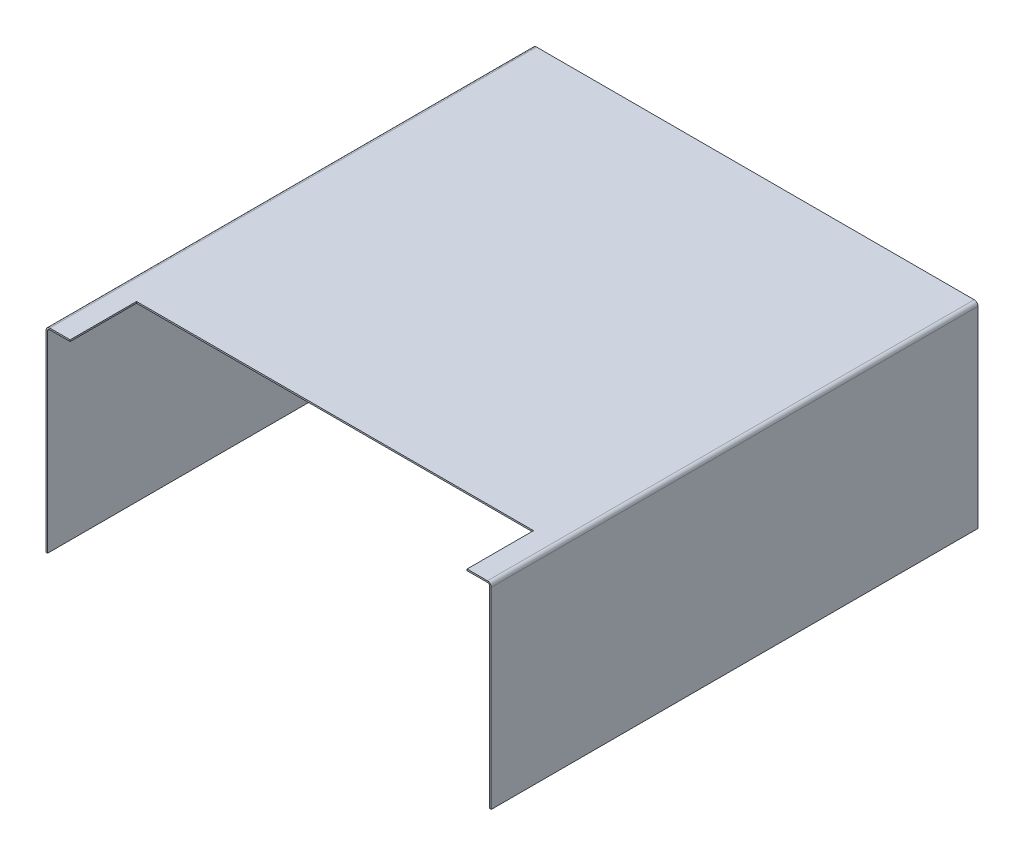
ISO-10303-21;
HEADER;
FILE_DESCRIPTION(('STEP AP214'),'2;1');
FILE_NAME('part.step','',(''),(''),'','','');
FILE_SCHEMA(('AUTOMOTIVE_DESIGN { 1 0 10303 214 1 1 1 1 }'));
ENDSEC;
DATA;
#1=APPLICATION_CONTEXT('core data for automotive mechanical design processes');
#2=APPLICATION_PROTOCOL_DEFINITION('international standard','automotive_design',2000,#1);
#3=PRODUCT_CONTEXT('',#1,'mechanical');
#4=PRODUCT('Part','Part','',(#3));
#5=PRODUCT_RELATED_PRODUCT_CATEGORY('part','',(#4));
#6=PRODUCT_DEFINITION_FORMATION('','',#4);
#7=PRODUCT_DEFINITION_CONTEXT('part definition',#1,'design');
#8=PRODUCT_DEFINITION('design','',#6,#7);
#9=PRODUCT_DEFINITION_SHAPE('','',#8);
#10=(LENGTH_UNIT() NAMED_UNIT(*) SI_UNIT(.MILLI.,.METRE.));
#11=(NAMED_UNIT(*) PLANE_ANGLE_UNIT() SI_UNIT($,.RADIAN.));
#12=(NAMED_UNIT(*) SI_UNIT($,.STERADIAN.) SOLID_ANGLE_UNIT());
#13=UNCERTAINTY_MEASURE_WITH_UNIT(LENGTH_MEASURE(1.E-05),#10,'distance_accuracy_value','');
#14=(GEOMETRIC_REPRESENTATION_CONTEXT(3) GLOBAL_UNCERTAINTY_ASSIGNED_CONTEXT((#13)) GLOBAL_UNIT_ASSIGNED_CONTEXT((#10,
#11,#12)) REPRESENTATION_CONTEXT('',''));
#15=CARTESIAN_POINT('',(0.,0.,0.));
#16=DIRECTION('',(0.,0.,1.));
#17=DIRECTION('',(1.,0.,0.));
#18=AXIS2_PLACEMENT_3D('',#15,#16,#17);
#19=CARTESIAN_POINT('',(-263.,250.,557.));
#20=DIRECTION('',(0.,0.,1.));
#21=DIRECTION('',(1.,0.,0.));
#22=AXIS2_PLACEMENT_3D('',#19,#20,#21);
#23=PLANE('',#22);
#24=DIRECTION('',(0.,1.,0.));
#25=VECTOR('',#24,1.);
#26=CARTESIAN_POINT('',(-263.,250.,557.));
#27=LINE('',#26,#25);
#28=CARTESIAN_POINT('',(-263.,258.,557.));
#29=VERTEX_POINT('',#28);
#30=CARTESIAN_POINT('',(-263.,260.,557.));
#31=VERTEX_POINT('',#30);
#32=EDGE_CURVE('E38',#29,#31,#27,.T.);
#33=ORIENTED_EDGE('',*,*,#32,.F.);
#34=DIRECTION('',(-1.,0.,0.));
#35=VECTOR('',#34,1.);
#36=CARTESIAN_POINT('',(13.5,258.,557.));
#37=LINE('',#36,#35);
#38=CARTESIAN_POINT('',(263.,258.,557.));
#39=VERTEX_POINT('',#38);
#40=EDGE_CURVE('E82',#39,#29,#37,.T.);
#41=ORIENTED_EDGE('',*,*,#40,.F.);
#42=DIRECTION('',(0.,1.,0.));
#43=VECTOR('',#42,1.);
#44=CARTESIAN_POINT('',(263.,250.,557.));
#45=LINE('',#44,#43);
#46=CARTESIAN_POINT('',(263.,260.,557.));
#47=VERTEX_POINT('',#46);
#48=EDGE_CURVE('E10',#39,#47,#45,.T.);
#49=ORIENTED_EDGE('',*,*,#48,.T.);
#50=DIRECTION('',(1.,0.,0.));
#51=VECTOR('',#50,1.);
#52=CARTESIAN_POINT('',(-276.5,260.,557.));
#53=LINE('',#52,#51);
#54=EDGE_CURVE('E122',#31,#47,#53,.T.);
#55=ORIENTED_EDGE('',*,*,#54,.F.);
#56=EDGE_LOOP('',(#33,#41,#49,#55));
#57=FACE_BOUND('',#56,.T.);
#58=ADVANCED_FACE('F16',(#57),#23,.T.);
#59=CARTESIAN_POINT('',(263.,250.,557.));
#60=DIRECTION('',(1.,0.,0.));
#61=DIRECTION('',(0.,1.,0.));
#62=AXIS2_PLACEMENT_3D('',#59,#60,#61);
#63=PLANE('',#62);
#64=DIRECTION('',(0.,-1.,0.));
#65=VECTOR('',#64,1.);
#66=CARTESIAN_POINT('',(263.,223.89585985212,645.));
#67=LINE('',#66,#65);
#68=CARTESIAN_POINT('',(263.,260.,645.));
#69=VERTEX_POINT('',#68);
#70=CARTESIAN_POINT('',(263.,258.,645.));
#71=VERTEX_POINT('',#70);
#72=EDGE_CURVE('E26',#69,#71,#67,.T.);
#73=ORIENTED_EDGE('',*,*,#72,.F.);
#74=DIRECTION('',(0.,0.,-1.));
#75=VECTOR('',#74,1.);
#76=CARTESIAN_POINT('',(263.,260.,278.5));
#77=LINE('',#76,#75);
#78=EDGE_CURVE('E125',#69,#47,#77,.T.);
#79=ORIENTED_EDGE('',*,*,#78,.T.);
#80=ORIENTED_EDGE('',*,*,#48,.F.);
#81=DIRECTION('',(0.,0.,1.));
#82=VECTOR('',#81,1.);
#83=CARTESIAN_POINT('',(263.,258.,278.5));
#84=LINE('',#83,#82);
#85=EDGE_CURVE('E78',#39,#71,#84,.T.);
#86=ORIENTED_EDGE('',*,*,#85,.T.);
#87=EDGE_LOOP('',(#73,#79,#80,#86));
#88=FACE_BOUND('',#87,.T.);
#89=ADVANCED_FACE('F18',(#88),#63,.F.);
#90=CARTESIAN_POINT('',(0.,197.79171970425,645.));
#91=DIRECTION('',(0.,0.,-1.));
#92=DIRECTION('',(0.,-1.,0.));
#93=AXIS2_PLACEMENT_3D('',#90,#91,#92);
#94=PLANE('',#93);
#95=DIRECTION('',(-1.,0.,0.));
#96=VECTOR('',#95,1.);
#97=CARTESIAN_POINT('',(290.,258.,645.));
#98=LINE('',#97,#96);
#99=CARTESIAN_POINT('',(290.,258.,645.));
#100=VERTEX_POINT('',#99);
#101=EDGE_CURVE('E66',#100,#71,#98,.T.);
#102=ORIENTED_EDGE('',*,*,#101,.F.);
#103=CARTESIAN_POINT('',(290.,255.,645.));
#104=DIRECTION('',(0.,0.,1.));
#105=DIRECTION('',(1.,0.,0.));
#106=AXIS2_PLACEMENT_3D('',#103,#104,#105);
#107=CIRCLE('',#106,3.);
#108=CARTESIAN_POINT('',(293.,255.,645.));
#109=VERTEX_POINT('',#108);
#110=EDGE_CURVE('E95',#109,#100,#107,.T.);
#111=ORIENTED_EDGE('',*,*,#110,.F.);
#112=DIRECTION('',(0.,1.,0.));
#113=VECTOR('',#112,1.);
#114=CARTESIAN_POINT('',(293.,0.,645.));
#115=LINE('',#114,#113);
#116=CARTESIAN_POINT('',(293.,0.,645.));
#117=VERTEX_POINT('',#116);
#118=EDGE_CURVE('E145',#117,#109,#115,.T.);
#119=ORIENTED_EDGE('',*,*,#118,.F.);
#120=DIRECTION('',(-1.,0.,0.));
#121=VECTOR('',#120,1.);
#122=CARTESIAN_POINT('',(295.,0.,645.));
#123=LINE('',#122,#121);
#124=CARTESIAN_POINT('',(295.,0.,645.));
#125=VERTEX_POINT('',#124);
#126=EDGE_CURVE('E146',#125,#117,#123,.T.);
#127=ORIENTED_EDGE('',*,*,#126,.F.);
#128=DIRECTION('',(0.,-1.,0.));
#129=VECTOR('',#128,1.);
#130=CARTESIAN_POINT('',(295.,255.,645.));
#131=LINE('',#130,#129);
#132=CARTESIAN_POINT('',(295.,255.,645.));
#133=VERTEX_POINT('',#132);
#134=EDGE_CURVE('E163',#133,#125,#131,.T.);
#135=ORIENTED_EDGE('',*,*,#134,.F.);
#136=CARTESIAN_POINT('',(290.,255.,645.));
#137=DIRECTION('',(0.,0.,1.));
#138=DIRECTION('',(1.,0.,0.));
#139=AXIS2_PLACEMENT_3D('',#136,#137,#138);
#140=CIRCLE('',#139,5.);
#141=CARTESIAN_POINT('',(290.,260.,645.));
#142=VERTEX_POINT('',#141);
#143=EDGE_CURVE('E154',#133,#142,#140,.T.);
#144=ORIENTED_EDGE('',*,*,#143,.T.);
#145=DIRECTION('',(1.,0.,0.));
#146=VECTOR('',#145,1.);
#147=CARTESIAN_POINT('',(-290.,260.,645.));
#148=LINE('',#147,#146);
#149=EDGE_CURVE('E71',#69,#142,#148,.T.);
#150=ORIENTED_EDGE('',*,*,#149,.F.);
#151=ORIENTED_EDGE('',*,*,#72,.T.);
#152=EDGE_LOOP('',(#102,#111,#119,#127,#135,#144,#150,#151));
#153=FACE_BOUND('',#152,.T.);
#154=ADVANCED_FACE('F64',(#153),#94,.F.);
#155=CARTESIAN_POINT('',(-263.,250.,557.));
#156=DIRECTION('',(1.,0.,0.));
#157=DIRECTION('',(0.,1.,0.));
#158=AXIS2_PLACEMENT_3D('',#155,#156,#157);
#159=PLANE('',#158);
#160=DIRECTION('',(0.,0.,1.));
#161=VECTOR('',#160,1.);
#162=CARTESIAN_POINT('',(-263.,258.,278.5));
#163=LINE('',#162,#161);
#164=CARTESIAN_POINT('',(-263.,258.,645.));
#165=VERTEX_POINT('',#164);
#166=EDGE_CURVE('E100',#29,#165,#163,.T.);
#167=ORIENTED_EDGE('',*,*,#166,.F.);
#168=ORIENTED_EDGE('',*,*,#32,.T.);
#169=DIRECTION('',(0.,0.,-1.));
#170=VECTOR('',#169,1.);
#171=CARTESIAN_POINT('',(-263.,260.,278.5));
#172=LINE('',#171,#170);
#173=CARTESIAN_POINT('',(-263.,260.,645.));
#174=VERTEX_POINT('',#173);
#175=EDGE_CURVE('E116',#174,#31,#172,.T.);
#176=ORIENTED_EDGE('',*,*,#175,.F.);
#177=DIRECTION('',(0.,-1.,0.));
#178=VECTOR('',#177,1.);
#179=CARTESIAN_POINT('',(-263.,223.89585985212,645.));
#180=LINE('',#179,#178);
#181=EDGE_CURVE('E325',#174,#165,#180,.T.);
#182=ORIENTED_EDGE('',*,*,#181,.T.);
#183=EDGE_LOOP('',(#167,#168,#176,#182));
#184=FACE_BOUND('',#183,.T.);
#185=ADVANCED_FACE('F112',(#184),#159,.T.);
#186=CARTESIAN_POINT('',(-290.,255.,0.));
#187=DIRECTION('',(0.,0.,-1.));
#188=DIRECTION('',(1.,0.,0.));
#189=AXIS2_PLACEMENT_3D('',#186,#187,#188);
#190=CYLINDRICAL_SURFACE('',#189,3.);
#191=DIRECTION('',(0.,0.,1.));
#192=VECTOR('',#191,1.);
#193=CARTESIAN_POINT('',(-290.,258.,0.));
#194=LINE('',#193,#192);
#195=CARTESIAN_POINT('',(-290.,258.,0.));
#196=VERTEX_POINT('',#195);
#197=CARTESIAN_POINT('',(-290.,258.,645.));
#198=VERTEX_POINT('',#197);
#199=EDGE_CURVE('E104',#196,#198,#194,.T.);
#200=ORIENTED_EDGE('',*,*,#199,.T.);
#201=CARTESIAN_POINT('',(-290.,255.,645.));
#202=DIRECTION('',(0.,0.,1.));
#203=DIRECTION('',(1.,0.,0.));
#204=AXIS2_PLACEMENT_3D('',#201,#202,#203);
#205=CIRCLE('',#204,3.);
#206=CARTESIAN_POINT('',(-293.,255.,645.));
#207=VERTEX_POINT('',#206);
#208=EDGE_CURVE('E295',#198,#207,#205,.T.);
#209=ORIENTED_EDGE('',*,*,#208,.T.);
#210=DIRECTION('',(0.,0.,1.));
#211=VECTOR('',#210,1.);
#212=CARTESIAN_POINT('',(-293.,255.,0.));
#213=LINE('',#212,#211);
#214=CARTESIAN_POINT('',(-293.,255.,0.));
#215=VERTEX_POINT('',#214);
#216=EDGE_CURVE('E134',#215,#207,#213,.T.);
#217=ORIENTED_EDGE('',*,*,#216,.F.);
#218=CARTESIAN_POINT('',(-290.,255.,0.));
#219=DIRECTION('',(0.,0.,1.));
#220=DIRECTION('',(1.,0.,0.));
#221=AXIS2_PLACEMENT_3D('',#218,#219,#220);
#222=CIRCLE('',#221,3.);
#223=EDGE_CURVE('E292',#196,#215,#222,.T.);
#224=ORIENTED_EDGE('',*,*,#223,.F.);
#225=EDGE_LOOP('',(#200,#209,#217,#224));
#226=FACE_BOUND('',#225,.T.);
#227=ADVANCED_FACE('F290',(#226),#190,.F.);
#228=CARTESIAN_POINT('',(290.,258.,0.));
#229=DIRECTION('',(0.,-1.,0.));
#230=DIRECTION('',(0.,0.,-1.));
#231=AXIS2_PLACEMENT_3D('',#228,#229,#230);
#232=PLANE('',#231);
#233=DIRECTION('',(-1.,0.,0.));
#234=VECTOR('',#233,1.);
#235=CARTESIAN_POINT('',(290.,258.,0.));
#236=LINE('',#235,#234);
#237=CARTESIAN_POINT('',(290.,258.,0.));
#238=VERTEX_POINT('',#237);
#239=EDGE_CURVE('E311',#238,#196,#236,.T.);
#240=ORIENTED_EDGE('',*,*,#239,.F.);
#241=DIRECTION('',(0.,0.,1.));
#242=VECTOR('',#241,1.);
#243=CARTESIAN_POINT('',(290.,258.,0.));
#244=LINE('',#243,#242);
#245=EDGE_CURVE('E87',#238,#100,#244,.T.);
#246=ORIENTED_EDGE('',*,*,#245,.T.);
#247=ORIENTED_EDGE('',*,*,#101,.T.);
#248=ORIENTED_EDGE('',*,*,#85,.F.);
#249=ORIENTED_EDGE('',*,*,#40,.T.);
#250=ORIENTED_EDGE('',*,*,#166,.T.);
#251=DIRECTION('',(-1.,0.,0.));
#252=VECTOR('',#251,1.);
#253=CARTESIAN_POINT('',(290.,258.,645.));
#254=LINE('',#253,#252);
#255=EDGE_CURVE('E323',#165,#198,#254,.T.);
#256=ORIENTED_EDGE('',*,*,#255,.T.);
#257=ORIENTED_EDGE('',*,*,#199,.F.);
#258=EDGE_LOOP('',(#240,#246,#247,#248,#249,#250,#256,#257));
#259=FACE_BOUND('',#258,.T.);
#260=ADVANCED_FACE('F85',(#259),#232,.T.);
#261=CARTESIAN_POINT('',(290.,255.,0.));
#262=DIRECTION('',(0.,0.,-1.));
#263=DIRECTION('',(1.,0.,0.));
#264=AXIS2_PLACEMENT_3D('',#261,#262,#263);
#265=CYLINDRICAL_SURFACE('',#264,3.);
#266=DIRECTION('',(0.,0.,1.));
#267=VECTOR('',#266,1.);
#268=CARTESIAN_POINT('',(293.,255.,0.));
#269=LINE('',#268,#267);
#270=CARTESIAN_POINT('',(293.,255.,0.));
#271=VERTEX_POINT('',#270);
#272=EDGE_CURVE('E177',#271,#109,#269,.T.);
#273=ORIENTED_EDGE('',*,*,#272,.T.);
#274=ORIENTED_EDGE('',*,*,#110,.T.);
#275=ORIENTED_EDGE('',*,*,#245,.F.);
#276=CARTESIAN_POINT('',(290.,255.,0.));
#277=DIRECTION('',(0.,0.,1.));
#278=DIRECTION('',(1.,0.,0.));
#279=AXIS2_PLACEMENT_3D('',#276,#277,#278);
#280=CIRCLE('',#279,3.);
#281=EDGE_CURVE('E316',#271,#238,#280,.T.);
#282=ORIENTED_EDGE('',*,*,#281,.F.);
#283=EDGE_LOOP('',(#273,#274,#275,#282));
#284=FACE_BOUND('',#283,.T.);
#285=ADVANCED_FACE('F185',(#284),#265,.F.);
#286=CARTESIAN_POINT('',(293.,0.,0.));
#287=DIRECTION('',(-1.,0.,0.));
#288=DIRECTION('',(0.,0.,1.));
#289=AXIS2_PLACEMENT_3D('',#286,#287,#288);
#290=PLANE('',#289);
#291=DIRECTION('',(0.,0.,1.));
#292=VECTOR('',#291,1.);
#293=CARTESIAN_POINT('',(293.,0.,0.));
#294=LINE('',#293,#292);
#295=CARTESIAN_POINT('',(293.,0.,0.));
#296=VERTEX_POINT('',#295);
#297=EDGE_CURVE('E143',#296,#117,#294,.T.);
#298=ORIENTED_EDGE('',*,*,#297,.T.);
#299=ORIENTED_EDGE('',*,*,#118,.T.);
#300=ORIENTED_EDGE('',*,*,#272,.F.);
#301=DIRECTION('',(0.,1.,0.));
#302=VECTOR('',#301,1.);
#303=CARTESIAN_POINT('',(293.,0.,0.));
#304=LINE('',#303,#302);
#305=EDGE_CURVE('E195',#296,#271,#304,.T.);
#306=ORIENTED_EDGE('',*,*,#305,.F.);
#307=EDGE_LOOP('',(#298,#299,#300,#306));
#308=FACE_BOUND('',#307,.T.);
#309=ADVANCED_FACE('F192',(#308),#290,.T.);
#310=CARTESIAN_POINT('',(295.,0.,0.));
#311=DIRECTION('',(0.,-1.,0.));
#312=DIRECTION('',(0.,0.,-1.));
#313=AXIS2_PLACEMENT_3D('',#310,#311,#312);
#314=PLANE('',#313);
#315=DIRECTION('',(0.,0.,1.));
#316=VECTOR('',#315,1.);
#317=CARTESIAN_POINT('',(295.,0.,0.));
#318=LINE('',#317,#316);
#319=CARTESIAN_POINT('',(295.,0.,0.));
#320=VERTEX_POINT('',#319);
#321=EDGE_CURVE('E167',#320,#125,#318,.T.);
#322=ORIENTED_EDGE('',*,*,#321,.T.);
#323=ORIENTED_EDGE('',*,*,#126,.T.);
#324=ORIENTED_EDGE('',*,*,#297,.F.);
#325=DIRECTION('',(-1.,0.,0.));
#326=VECTOR('',#325,1.);
#327=CARTESIAN_POINT('',(295.,0.,0.));
#328=LINE('',#327,#326);
#329=EDGE_CURVE('E202',#320,#296,#328,.T.);
#330=ORIENTED_EDGE('',*,*,#329,.F.);
#331=EDGE_LOOP('',(#322,#323,#324,#330));
#332=FACE_BOUND('',#331,.T.);
#333=ADVANCED_FACE('F199',(#332),#314,.T.);
#334=CARTESIAN_POINT('',(295.,255.,0.));
#335=DIRECTION('',(1.,0.,0.));
#336=DIRECTION('',(0.,1.,0.));
#337=AXIS2_PLACEMENT_3D('',#334,#335,#336);
#338=PLANE('',#337);
#339=DIRECTION('',(0.,0.,1.));
#340=VECTOR('',#339,1.);
#341=CARTESIAN_POINT('',(295.,255.,0.));
#342=LINE('',#341,#340);
#343=CARTESIAN_POINT('',(295.,255.,0.));
#344=VERTEX_POINT('',#343);
#345=EDGE_CURVE('E159',#344,#133,#342,.T.);
#346=ORIENTED_EDGE('',*,*,#345,.T.);
#347=ORIENTED_EDGE('',*,*,#134,.T.);
#348=ORIENTED_EDGE('',*,*,#321,.F.);
#349=DIRECTION('',(0.,-1.,0.));
#350=VECTOR('',#349,1.);
#351=CARTESIAN_POINT('',(295.,255.,0.));
#352=LINE('',#351,#350);
#353=EDGE_CURVE('E356',#344,#320,#352,.T.);
#354=ORIENTED_EDGE('',*,*,#353,.F.);
#355=EDGE_LOOP('',(#346,#347,#348,#354));
#356=FACE_BOUND('',#355,.T.);
#357=ADVANCED_FACE('F207',(#356),#338,.T.);
#358=CARTESIAN_POINT('',(290.,255.,0.));
#359=DIRECTION('',(0.,0.,-1.));
#360=DIRECTION('',(1.,0.,0.));
#361=AXIS2_PLACEMENT_3D('',#358,#359,#360);
#362=CYLINDRICAL_SURFACE('',#361,5.);
#363=CARTESIAN_POINT('',(290.,255.,0.));
#364=DIRECTION('',(0.,0.,1.));
#365=DIRECTION('',(1.,0.,0.));
#366=AXIS2_PLACEMENT_3D('',#363,#364,#365);
#367=CIRCLE('',#366,5.);
#368=CARTESIAN_POINT('',(290.,260.,0.));
#369=VERTEX_POINT('',#368);
#370=EDGE_CURVE('E355',#344,#369,#367,.T.);
#371=ORIENTED_EDGE('',*,*,#370,.T.);
#372=DIRECTION('',(0.,0.,1.));
#373=VECTOR('',#372,1.);
#374=CARTESIAN_POINT('',(290.,260.,0.));
#375=LINE('',#374,#373);
#376=EDGE_CURVE('E150',#369,#142,#375,.T.);
#377=ORIENTED_EDGE('',*,*,#376,.T.);
#378=ORIENTED_EDGE('',*,*,#143,.F.);
#379=ORIENTED_EDGE('',*,*,#345,.F.);
#380=EDGE_LOOP('',(#371,#377,#378,#379));
#381=FACE_BOUND('',#380,.T.);
#382=ADVANCED_FACE('F405',(#381),#362,.T.);
#383=CARTESIAN_POINT('',(-290.,260.,0.));
#384=DIRECTION('',(0.,1.,0.));
#385=DIRECTION('',(1.,0.,0.));
#386=AXIS2_PLACEMENT_3D('',#383,#384,#385);
#387=PLANE('',#386);
#388=DIRECTION('',(1.,0.,0.));
#389=VECTOR('',#388,1.);
#390=CARTESIAN_POINT('',(-290.,260.,0.));
#391=LINE('',#390,#389);
#392=CARTESIAN_POINT('',(-290.,260.,0.));
#393=VERTEX_POINT('',#392);
#394=EDGE_CURVE('E351',#393,#369,#391,.T.);
#395=ORIENTED_EDGE('',*,*,#394,.F.);
#396=DIRECTION('',(0.,0.,1.));
#397=VECTOR('',#396,1.);
#398=CARTESIAN_POINT('',(-290.,260.,0.));
#399=LINE('',#398,#397);
#400=CARTESIAN_POINT('',(-290.,260.,645.));
#401=VERTEX_POINT('',#400);
#402=EDGE_CURVE('E348',#393,#401,#399,.T.);
#403=ORIENTED_EDGE('',*,*,#402,.T.);
#404=DIRECTION('',(1.,0.,0.));
#405=VECTOR('',#404,1.);
#406=CARTESIAN_POINT('',(-290.,260.,645.));
#407=LINE('',#406,#405);
#408=EDGE_CURVE('E131',#401,#174,#407,.T.);
#409=ORIENTED_EDGE('',*,*,#408,.T.);
#410=ORIENTED_EDGE('',*,*,#175,.T.);
#411=ORIENTED_EDGE('',*,*,#54,.T.);
#412=ORIENTED_EDGE('',*,*,#78,.F.);
#413=ORIENTED_EDGE('',*,*,#149,.T.);
#414=ORIENTED_EDGE('',*,*,#376,.F.);
#415=EDGE_LOOP('',(#395,#403,#409,#410,#411,#412,#413,#414));
#416=FACE_BOUND('',#415,.T.);
#417=ADVANCED_FACE('F128',(#416),#387,.T.);
#418=CARTESIAN_POINT('',(-293.,255.,0.));
#419=DIRECTION('',(1.,0.,0.));
#420=DIRECTION('',(0.,1.,0.));
#421=AXIS2_PLACEMENT_3D('',#418,#419,#420);
#422=PLANE('',#421);
#423=ORIENTED_EDGE('',*,*,#216,.T.);
#424=DIRECTION('',(0.,-1.,0.));
#425=VECTOR('',#424,1.);
#426=CARTESIAN_POINT('',(-293.,255.,645.));
#427=LINE('',#426,#425);
#428=CARTESIAN_POINT('',(-293.,0.,645.));
#429=VERTEX_POINT('',#428);
#430=EDGE_CURVE('E306',#207,#429,#427,.T.);
#431=ORIENTED_EDGE('',*,*,#430,.T.);
#432=DIRECTION('',(0.,0.,1.));
#433=VECTOR('',#432,1.);
#434=CARTESIAN_POINT('',(-293.,0.,0.));
#435=LINE('',#434,#433);
#436=CARTESIAN_POINT('',(-293.,0.,0.));
#437=VERTEX_POINT('',#436);
#438=EDGE_CURVE('E302',#437,#429,#435,.T.);
#439=ORIENTED_EDGE('',*,*,#438,.F.);
#440=DIRECTION('',(0.,-1.,0.));
#441=VECTOR('',#440,1.);
#442=CARTESIAN_POINT('',(-293.,255.,0.));
#443=LINE('',#442,#441);
#444=EDGE_CURVE('E299',#215,#437,#443,.T.);
#445=ORIENTED_EDGE('',*,*,#444,.F.);
#446=EDGE_LOOP('',(#423,#431,#439,#445));
#447=FACE_BOUND('',#446,.T.);
#448=ADVANCED_FACE('F300',(#447),#422,.T.);
#449=CARTESIAN_POINT('',(0.,197.79171970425,645.));
#450=DIRECTION('',(0.,0.,-1.));
#451=DIRECTION('',(0.,-1.,0.));
#452=AXIS2_PLACEMENT_3D('',#449,#450,#451);
#453=PLANE('',#452);
#454=ORIENTED_EDGE('',*,*,#430,.F.);
#455=ORIENTED_EDGE('',*,*,#208,.F.);
#456=ORIENTED_EDGE('',*,*,#255,.F.);
#457=ORIENTED_EDGE('',*,*,#181,.F.);
#458=ORIENTED_EDGE('',*,*,#408,.F.);
#459=CARTESIAN_POINT('',(-290.,255.,645.));
#460=DIRECTION('',(0.,0.,1.));
#461=DIRECTION('',(1.,0.,0.));
#462=AXIS2_PLACEMENT_3D('',#459,#460,#461);
#463=CIRCLE('',#462,5.);
#464=CARTESIAN_POINT('',(-295.,255.,645.));
#465=VERTEX_POINT('',#464);
#466=EDGE_CURVE('E345',#401,#465,#463,.T.);
#467=ORIENTED_EDGE('',*,*,#466,.T.);
#468=DIRECTION('',(0.,1.,0.));
#469=VECTOR('',#468,1.);
#470=CARTESIAN_POINT('',(-295.,0.,645.));
#471=LINE('',#470,#469);
#472=CARTESIAN_POINT('',(-295.,0.,645.));
#473=VERTEX_POINT('',#472);
#474=EDGE_CURVE('E380',#473,#465,#471,.T.);
#475=ORIENTED_EDGE('',*,*,#474,.F.);
#476=DIRECTION('',(-1.,0.,0.));
#477=VECTOR('',#476,1.);
#478=CARTESIAN_POINT('',(-293.,0.,645.));
#479=LINE('',#478,#477);
#480=EDGE_CURVE('E337',#429,#473,#479,.T.);
#481=ORIENTED_EDGE('',*,*,#480,.F.);
#482=EDGE_LOOP('',(#454,#455,#456,#457,#458,#467,#475,#481));
#483=FACE_BOUND('',#482,.T.);
#484=ADVANCED_FACE('F398',(#483),#453,.F.);
#485=CARTESIAN_POINT('',(0.,197.79171970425,0.));
#486=DIRECTION('',(0.,0.,-1.));
#487=DIRECTION('',(0.,-1.,0.));
#488=AXIS2_PLACEMENT_3D('',#485,#486,#487);
#489=PLANE('',#488);
#490=DIRECTION('',(0.,1.,0.));
#491=VECTOR('',#490,1.);
#492=CARTESIAN_POINT('',(-295.,0.,0.));
#493=LINE('',#492,#491);
#494=CARTESIAN_POINT('',(-295.,0.,0.));
#495=VERTEX_POINT('',#494);
#496=CARTESIAN_POINT('',(-295.,255.,0.));
#497=VERTEX_POINT('',#496);
#498=EDGE_CURVE('E369',#495,#497,#493,.T.);
#499=ORIENTED_EDGE('',*,*,#498,.T.);
#500=CARTESIAN_POINT('',(-290.,255.,0.));
#501=DIRECTION('',(0.,0.,1.));
#502=DIRECTION('',(1.,0.,0.));
#503=AXIS2_PLACEMENT_3D('',#500,#501,#502);
#504=CIRCLE('',#503,5.);
#505=EDGE_CURVE('E342',#393,#497,#504,.T.);
#506=ORIENTED_EDGE('',*,*,#505,.F.);
#507=ORIENTED_EDGE('',*,*,#394,.T.);
#508=ORIENTED_EDGE('',*,*,#370,.F.);
#509=ORIENTED_EDGE('',*,*,#353,.T.);
#510=ORIENTED_EDGE('',*,*,#329,.T.);
#511=ORIENTED_EDGE('',*,*,#305,.T.);
#512=ORIENTED_EDGE('',*,*,#281,.T.);
#513=ORIENTED_EDGE('',*,*,#239,.T.);
#514=ORIENTED_EDGE('',*,*,#223,.T.);
#515=ORIENTED_EDGE('',*,*,#444,.T.);
#516=DIRECTION('',(-1.,0.,0.));
#517=VECTOR('',#516,1.);
#518=CARTESIAN_POINT('',(-293.,0.,0.));
#519=LINE('',#518,#517);
#520=EDGE_CURVE('E339',#437,#495,#519,.T.);
#521=ORIENTED_EDGE('',*,*,#520,.T.);
#522=EDGE_LOOP('',(#499,#506,#507,#508,#509,#510,#511,#512,#513,#514,#515,#521));
#523=FACE_BOUND('',#522,.T.);
#524=ADVANCED_FACE('F309',(#523),#489,.T.);
#525=CARTESIAN_POINT('',(-290.,255.,0.));
#526=DIRECTION('',(0.,0.,-1.));
#527=DIRECTION('',(1.,0.,0.));
#528=AXIS2_PLACEMENT_3D('',#525,#526,#527);
#529=CYLINDRICAL_SURFACE('',#528,5.);
#530=ORIENTED_EDGE('',*,*,#505,.T.);
#531=DIRECTION('',(0.,0.,1.));
#532=VECTOR('',#531,1.);
#533=CARTESIAN_POINT('',(-295.,255.,0.));
#534=LINE('',#533,#532);
#535=EDGE_CURVE('E368',#497,#465,#534,.T.);
#536=ORIENTED_EDGE('',*,*,#535,.T.);
#537=ORIENTED_EDGE('',*,*,#466,.F.);
#538=ORIENTED_EDGE('',*,*,#402,.F.);
#539=EDGE_LOOP('',(#530,#536,#537,#538));
#540=FACE_BOUND('',#539,.T.);
#541=ADVANCED_FACE('F402',(#540),#529,.T.);
#542=CARTESIAN_POINT('',(-293.,0.,0.));
#543=DIRECTION('',(0.,-1.,0.));
#544=DIRECTION('',(0.,0.,-1.));
#545=AXIS2_PLACEMENT_3D('',#542,#543,#544);
#546=PLANE('',#545);
#547=ORIENTED_EDGE('',*,*,#438,.T.);
#548=ORIENTED_EDGE('',*,*,#480,.T.);
#549=DIRECTION('',(0.,0.,1.));
#550=VECTOR('',#549,1.);
#551=CARTESIAN_POINT('',(-295.,0.,0.));
#552=LINE('',#551,#550);
#553=EDGE_CURVE('E386',#495,#473,#552,.T.);
#554=ORIENTED_EDGE('',*,*,#553,.F.);
#555=ORIENTED_EDGE('',*,*,#520,.F.);
#556=EDGE_LOOP('',(#547,#548,#554,#555));
#557=FACE_BOUND('',#556,.T.);
#558=ADVANCED_FACE('F395',(#557),#546,.T.);
#559=CARTESIAN_POINT('',(-295.,0.,0.));
#560=DIRECTION('',(-1.,0.,0.));
#561=DIRECTION('',(0.,0.,1.));
#562=AXIS2_PLACEMENT_3D('',#559,#560,#561);
#563=PLANE('',#562);
#564=ORIENTED_EDGE('',*,*,#553,.T.);
#565=ORIENTED_EDGE('',*,*,#474,.T.);
#566=ORIENTED_EDGE('',*,*,#535,.F.);
#567=ORIENTED_EDGE('',*,*,#498,.F.);
#568=EDGE_LOOP('',(#564,#565,#566,#567));
#569=FACE_BOUND('',#568,.T.);
#570=ADVANCED_FACE('F393',(#569),#563,.T.);
#571=CLOSED_SHELL('',(#58,#89,#154,#185,#227,#260,#285,#309,#333,#357,#382,#417,#448,#484,#524,
#541,#558,#570));
#572=MANIFOLD_SOLID_BREP('B1',#571);
#573=ADVANCED_BREP_SHAPE_REPRESENTATION('',(#18,#572),#14);
#574=SHAPE_DEFINITION_REPRESENTATION(#9,#573);
ENDSEC;
END-ISO-10303-21;
